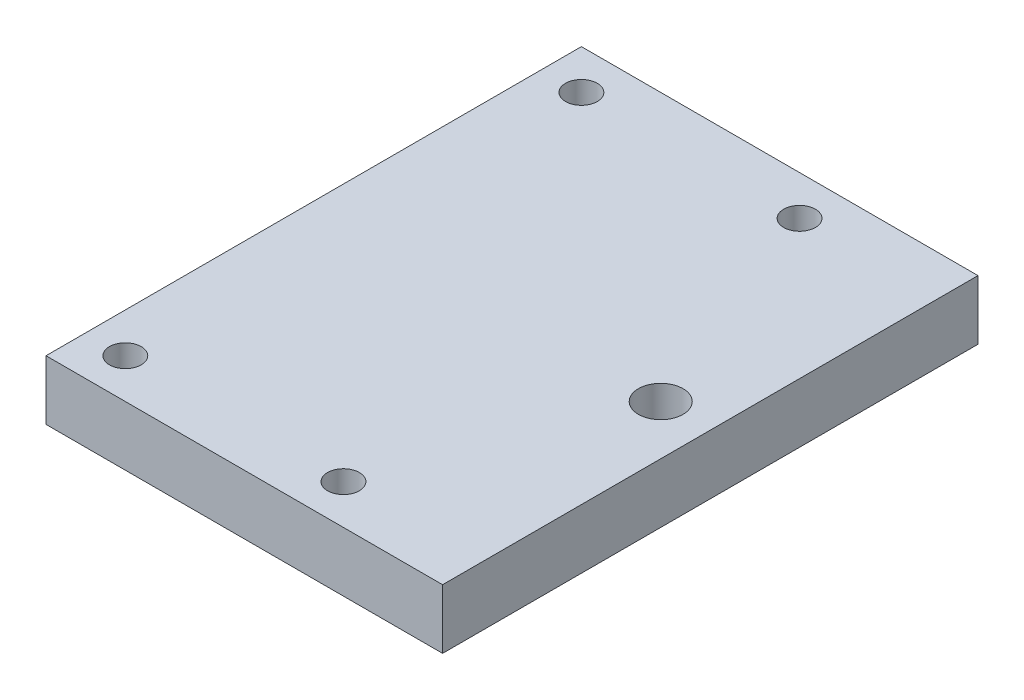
from build123d import *

# Parameters (mm, degrees)
ESQUISSE2_W             = 30
ESQUISSE2_H             = 54
ESQUISSE2_R             = 1.6002
EXTRUSION1_DEPTH        = 6
ESQUISSE3_W             = 54
ESQUISSE3_H             = 6
EXTRUSION2_DEPTH        = 10
ESQUISSE4_R             = 2.25
ENL_V_MAT_EXTRU_1_DEPTH = 68.468511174


with BuildPart() as part:
    # Esquisse2 → Extrusion1 (new body)
    with BuildSketch(Plane(origin=(0, 0, 0), x_dir=(1, 0, 0), z_dir=(0, 1, 0))):
        with Locations((15, 27)):
            Rectangle(ESQUISSE2_W, ESQUISSE2_H)
        with Locations(Location((4.0005, 49.9999, 0), (0, 0, 270))):
            Circle(ESQUISSE2_R, mode=Mode.SUBTRACT)
        with Locations(Location((25.99944, 49.9999, 0), (0, 0, 270))):
            Circle(ESQUISSE2_R, mode=Mode.SUBTRACT)
        with Locations(Location((4.0005, 4.0005, 0), (0, 0, 270))):
            Circle(ESQUISSE2_R, mode=Mode.SUBTRACT)
        with Locations(Location((25.99944, 4.0005, 0), (0, 0, 270))):
            Circle(ESQUISSE2_R, mode=Mode.SUBTRACT)
    extrude(amount=EXTRUSION1_DEPTH)

    # Esquisse3 → Extrusion2 (add)
    with BuildSketch(Plane(origin=(30, 0, 0), x_dir=(0, 0, -1), z_dir=(1, 0, 0))):
        with Locations((27, 3)):
            Rectangle(ESQUISSE3_W, ESQUISSE3_H)
    extrude(amount=EXTRUSION2_DEPTH)

    # Esquisse4 → Enl_v. mat.-Extru.1 (cut, through all)
    with BuildSketch(Plane(origin=(0, 6, 0), x_dir=(-1, 0, 0), z_dir=(0, 1, 0))):
        with Locations(Location((-35, -27, 0), (0, 0, 90))):
            Circle(ESQUISSE4_R)
    extrude(amount=-ENL_V_MAT_EXTRU_1_DEPTH, mode=Mode.SUBTRACT)


solid = part.part
